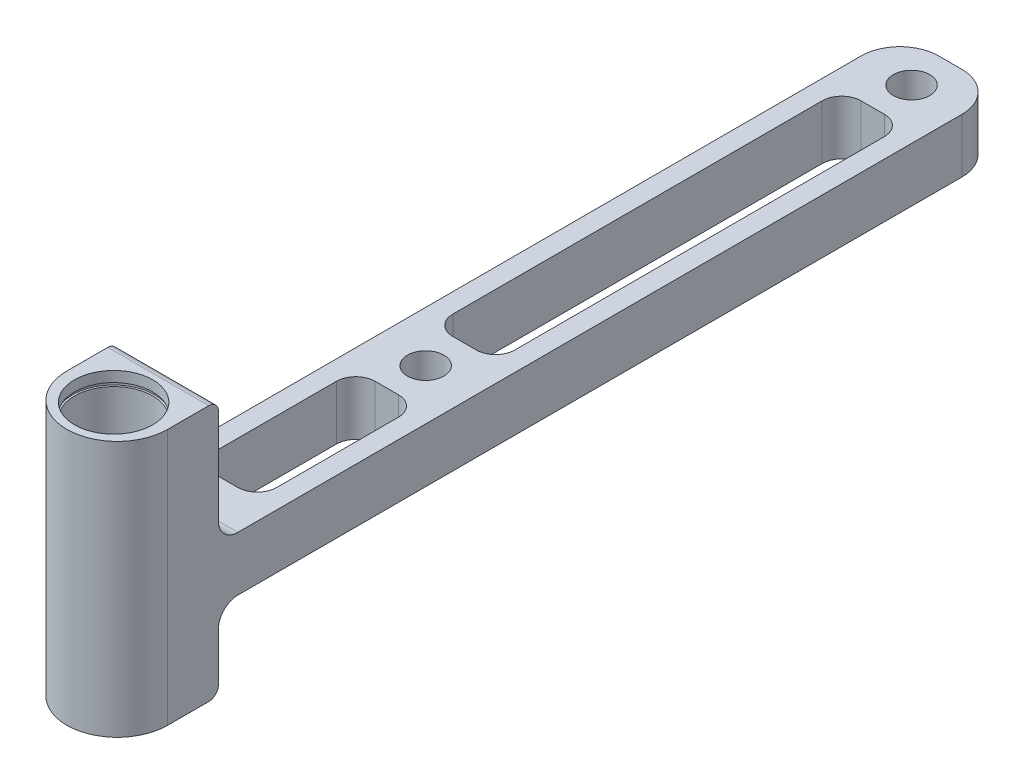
from build123d import *

# Parameters (mm, degrees)
SKETCH1_R                        = 6.3881
BOSS_EXTRUDE1_DEPTH              = 20.955
BOSS_EXTRUDE2_DEPTH              = 16.51
SKETCH3_R                        = 6.3881
SKETCH3_R_2                      = 5.7531
BOSS_EXTRUDE3_DEPTH              = 1.27
F_15_64_0_23438_DIAMETER_HOLE1_D = 5.953252
SKETCH4_W                        = 16.51
SKETCH4_H                        = 5.410438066
CUT_EXTRUDE1_DEPTH               = 149.515355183
SKETCH7_W                        = 2.54
SKETCH7_H                        = 0.5588
FILLET1_R                        = 6.35
FILLET2_R                        = 1.5875


with BuildPart() as part:
    # Sketch1 → Boss-Extrude1 (new, symmetric)
    with BuildSketch(Plane(origin=(0, 0, 0), x_dir=(1, 0, 0), z_dir=(0, 1, 0))):
        with BuildLine():
            Line((-8.255, 0.5969), (-8.255, 8.89))
            Line((-8.255, 8.89), (8.255, 8.89))
            Line((8.255, 8.89), (8.255, 0.5969))
            ThreePointArc((8.255, 0.5969), (0, -7.6581), (-8.255, 0.5969))
        make_face()
        with Locations(Location((0, 0, 0), (0, 0, 270))):
            Circle(SKETCH1_R, mode=Mode.SUBTRACT)
    extrude(amount=BOSS_EXTRUDE1_DEPTH, both=True)

    # Sketch2 → Boss-Extrude2 (add)
    with BuildSketch(Plane(origin=(8.255, 0, 0), x_dir=(0, 0, -1), z_dir=(1, 0, 0))):
        with BuildLine():
            Line((12.065, 0.635), (142.24, 0.635))
            Line((142.24, 0.635), (142.24, -8.255))
            Line((142.24, -8.255), (12.065, -8.255))
            ThreePointArc((12.065, -8.255), (9.81993597, -9.18493597), (8.89, -11.43))
            Line((8.89, -11.43), (8.89, 3.81))
            ThreePointArc((8.89, 3.81), (9.81993597, 1.56493597), (12.065, 0.635))
        make_face()
    extrude(amount=-BOSS_EXTRUDE2_DEPTH)

    # Sketch3 → Boss-Extrude3 (add)
    with BuildSketch(Plane.XZ.offset(20.955)):
        with Locations(Location((0, 0, 0), (0, 0, 270))):
            Circle(SKETCH3_R)
        with Locations(Location((0, 0, 0), (0, 0, 270))):
            Circle(SKETCH3_R_2, mode=Mode.SUBTRACT)
    extrude(amount=-BOSS_EXTRUDE3_DEPTH)

    # 15_64 _0.23438_ Diameter Hole1 (through all)
    with Locations(Plane(origin=(0, 0.635, 0), x_dir=(1, 0, 0), z_dir=(0, 1, 0))):
        with Locations((0, 130.479561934), (0, 51.026977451)):
            Hole(F_15_64_0_23438_DIAMETER_HOLE1_D / 2)

    # Sketch4 → Cut-Extrude1 (cut, through all)
    with BuildSketch(Plane(origin=(0, 20.955, 0), x_dir=(1, 0, 0), z_dir=(0, 1, 0))):
        with BuildLine():
            Line((5.08, 120.954561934), (5.08, 60.551977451))
            ThreePointArc((5.08, 60.551977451), (4.15006403, 58.306913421), (1.905, 57.376977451))
            Line((1.905, 57.376977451), (-1.905, 57.376977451))
            ThreePointArc((-1.905, 57.376977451), (-4.15006403, 58.306913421), (-5.08, 60.551977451))
            Line((-5.08, 60.551977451), (-5.08, 120.954561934))
            ThreePointArc((-5.08, 120.954561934), (-4.15006403, 123.199625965), (-1.905, 124.129561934))
            Line((-1.905, 124.129561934), (1.905, 124.129561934))
            ThreePointArc((1.905, 124.129561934), (4.15006403, 123.199625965), (5.08, 120.954561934))
        make_face()
        with BuildLine():
            Line((-1.905, 18.415), (1.905, 18.415))
            ThreePointArc((1.905, 18.415), (4.15006403, 19.34493597), (5.08, 21.59))
            Line((5.08, 21.59), (5.08, 41.501977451))
            ThreePointArc((5.08, 41.501977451), (4.15006403, 43.747041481), (1.905, 44.676977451))
            Line((1.905, 44.676977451), (-1.905, 44.676977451))
            ThreePointArc((-1.905, 44.676977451), (-4.15006403, 43.747041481), (-5.08, 41.501977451))
            Line((-5.08, 41.501977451), (-5.08, 21.59))
            ThreePointArc((-5.08, 21.59), (-4.15006403, 19.34493597), (-1.905, 18.415))
        make_face()
        with Locations((0, 139.534780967)):
            Rectangle(SKETCH4_W, SKETCH4_H)
    extrude(amount=-CUT_EXTRUDE1_DEPTH, mode=Mode.SUBTRACT)

    # Sketch7 → Cut-Revolve1 (revolve, cut)
    with BuildSketch(Plane.XY, mode=Mode.PRIVATE) as cut_revolve1_sk:
        with Locations((-5.4356, 18.9484)):
            Rectangle(SKETCH7_W, SKETCH7_H)
    revolve(cut_revolve1_sk.sketch.rotate(Axis((0, 0, 0), (0, 1, 0)), 270), axis=Axis((0, 0, 0), (0, 1, 0)), mode=Mode.SUBTRACT)

    # Fillet1
    fillet1_edges = [part.edges().sort_by_distance(p)[0] for p in [
        (-8.255, -3.81, -136.829561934),
        (8.255, -3.81, -136.829561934),
    ]]
    fillet(fillet1_edges, radius=FILLET1_R)

    # Fillet2
    fillet2_edges = [part.edges().sort_by_distance(p)[0] for p in [
        (0, -20.955, -8.89),
        (0, 20.955, -8.89),
    ]]
    fillet(fillet2_edges, radius=FILLET2_R)


solid = part.part
